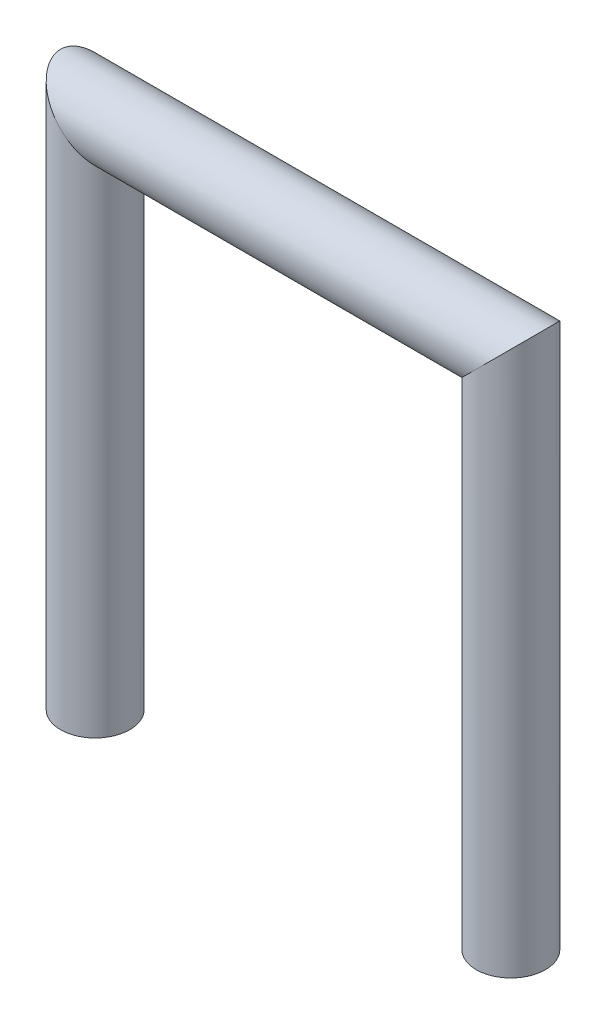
from build123d import *

# Parameters (mm, degrees)
SKETCH3_R = 6.35


with BuildPart() as part:
    # Sweep4: sweep along a path in Sketch1
    with BuildLine(Plane.XY) as sweep4_path:
        Line((0, 0), (0, 95.330994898))
        Line((0, 95.330994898), (76.2, 95.330994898))
        Line((76.2, 95.330994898), (76.2, 0))
    # Sketch3 → Sweep4 (sweep)
    with BuildSketch(Plane(origin=(0, 0, 0), x_dir=(1, 0, 0), z_dir=(0, 1, 0))):
        with Locations((76.2, 0)):
            Circle(SKETCH3_R)
    sweep(path=sweep4_path.line, transition=Transition.RIGHT)


solid = part.part
